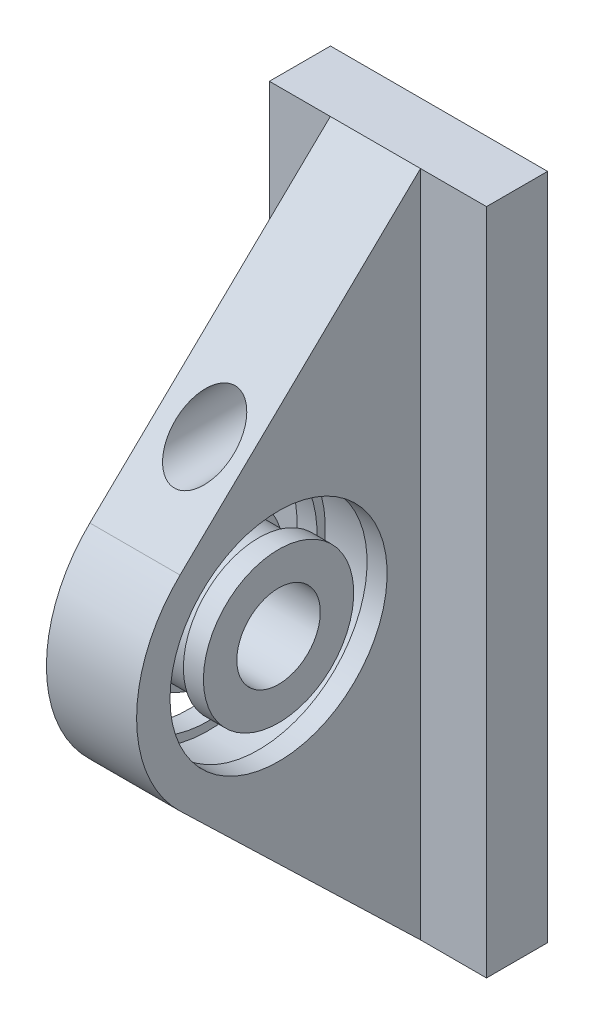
ISO-10303-21;
HEADER;
FILE_DESCRIPTION(('STEP AP214'),'2;1');
FILE_NAME('part.step','',(''),(''),'','','');
FILE_SCHEMA(('AUTOMOTIVE_DESIGN { 1 0 10303 214 1 1 1 1 }'));
ENDSEC;
DATA;
#1=APPLICATION_CONTEXT('core data for automotive mechanical design processes');
#2=APPLICATION_PROTOCOL_DEFINITION('international standard','automotive_design',2000,#1);
#3=PRODUCT_CONTEXT('',#1,'mechanical');
#4=PRODUCT('Part','Part','',(#3));
#5=PRODUCT_RELATED_PRODUCT_CATEGORY('part','',(#4));
#6=PRODUCT_DEFINITION_FORMATION('','',#4);
#7=PRODUCT_DEFINITION_CONTEXT('part definition',#1,'design');
#8=PRODUCT_DEFINITION('design','',#6,#7);
#9=PRODUCT_DEFINITION_SHAPE('','',#8);
#10=(LENGTH_UNIT() NAMED_UNIT(*) SI_UNIT(.MILLI.,.METRE.));
#11=(NAMED_UNIT(*) PLANE_ANGLE_UNIT() SI_UNIT($,.RADIAN.));
#12=(NAMED_UNIT(*) SI_UNIT($,.STERADIAN.) SOLID_ANGLE_UNIT());
#13=UNCERTAINTY_MEASURE_WITH_UNIT(LENGTH_MEASURE(1.E-05),#10,'distance_accuracy_value','');
#14=(GEOMETRIC_REPRESENTATION_CONTEXT(3) GLOBAL_UNCERTAINTY_ASSIGNED_CONTEXT((#13)) GLOBAL_UNIT_ASSIGNED_CONTEXT((#10,
#11,#12)) REPRESENTATION_CONTEXT('',''));
#15=CARTESIAN_POINT('',(0.,0.,0.));
#16=DIRECTION('',(0.,0.,1.));
#17=DIRECTION('',(1.,0.,0.));
#18=AXIS2_PLACEMENT_3D('',#15,#16,#17);
#19=CARTESIAN_POINT('',(19.2380020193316,4.49010040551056,0.));
#20=DIRECTION('',(1.,0.,0.));
#21=DIRECTION('',(0.,0.,-1.));
#22=AXIS2_PLACEMENT_3D('',#19,#20,#21);
#23=PLANE('',#22);
#24=CARTESIAN_POINT('',(19.2380020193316,1.99010040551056,0.));
#25=DIRECTION('',(-1.,0.,0.));
#26=DIRECTION('',(0.,0.,1.));
#27=AXIS2_PLACEMENT_3D('',#24,#25,#26);
#28=CIRCLE('',#27,2.5);
#29=CARTESIAN_POINT('',(19.2380020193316,1.99010040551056,2.5));
#30=VERTEX_POINT('',#29);
#31=EDGE_CURVE('E68',#30,#30,#28,.T.);
#32=ORIENTED_EDGE('',*,*,#31,.F.);
#33=EDGE_LOOP('',(#32));
#34=FACE_BOUND('',#33,.T.);
#35=CARTESIAN_POINT('',(19.2380020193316,1.99010040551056,0.));
#36=DIRECTION('',(-1.,0.,0.));
#37=DIRECTION('',(0.,0.,1.));
#38=AXIS2_PLACEMENT_3D('',#35,#36,#37);
#39=CIRCLE('',#38,4.5);
#40=CARTESIAN_POINT('',(19.2380020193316,1.99010040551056,4.5));
#41=VERTEX_POINT('',#40);
#42=EDGE_CURVE('E11',#41,#41,#39,.T.);
#43=ORIENTED_EDGE('',*,*,#42,.T.);
#44=EDGE_LOOP('',(#43));
#45=FACE_BOUND('',#44,.T.);
#46=ADVANCED_FACE('F40',(#34,#45),#23,.F.);
#47=CARTESIAN_POINT('',(17.1856373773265,1.99010040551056,0.));
#48=DIRECTION('',(-1.,0.,0.));
#49=DIRECTION('',(0.,0.,1.));
#50=AXIS2_PLACEMENT_3D('',#47,#48,#49);
#51=CYLINDRICAL_SURFACE('',#50,4.5);
#52=ORIENTED_EDGE('',*,*,#42,.F.);
#53=EDGE_LOOP('',(#52));
#54=FACE_BOUND('',#53,.T.);
#55=CARTESIAN_POINT('',(20.4380020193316,1.99010040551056,0.));
#56=DIRECTION('',(-1.,0.,0.));
#57=DIRECTION('',(0.,0.,1.));
#58=AXIS2_PLACEMENT_3D('',#55,#56,#57);
#59=CIRCLE('',#58,4.5);
#60=CARTESIAN_POINT('',(20.4380020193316,1.99010040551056,4.5));
#61=VERTEX_POINT('',#60);
#62=EDGE_CURVE('E46',#61,#61,#59,.T.);
#63=ORIENTED_EDGE('',*,*,#62,.T.);
#64=EDGE_LOOP('',(#63));
#65=FACE_BOUND('',#64,.T.);
#66=ADVANCED_FACE('F75',(#54,#65),#51,.T.);
#67=CARTESIAN_POINT('',(20.4380020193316,6.49010040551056,0.));
#68=DIRECTION('',(-1.,0.,0.));
#69=DIRECTION('',(0.,0.,1.));
#70=AXIS2_PLACEMENT_3D('',#67,#68,#69);
#71=PLANE('',#70);
#72=ORIENTED_EDGE('',*,*,#62,.F.);
#73=EDGE_LOOP('',(#72));
#74=FACE_BOUND('',#73,.T.);
#75=CARTESIAN_POINT('',(20.4380020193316,1.99010040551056,0.));
#76=DIRECTION('',(-1.,0.,0.));
#77=DIRECTION('',(0.,0.,1.));
#78=AXIS2_PLACEMENT_3D('',#75,#76,#77);
#79=CIRCLE('',#78,4.);
#80=CARTESIAN_POINT('',(20.4380020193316,1.99010040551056,4.));
#81=VERTEX_POINT('',#80);
#82=EDGE_CURVE('E50',#81,#81,#79,.T.);
#83=ORIENTED_EDGE('',*,*,#82,.T.);
#84=EDGE_LOOP('',(#83));
#85=FACE_BOUND('',#84,.T.);
#86=ADVANCED_FACE('F79',(#74,#85),#71,.F.);
#87=CARTESIAN_POINT('',(17.1856373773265,1.99010040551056,0.));
#88=DIRECTION('',(-1.,0.,0.));
#89=DIRECTION('',(0.,0.,1.));
#90=AXIS2_PLACEMENT_3D('',#87,#88,#89);
#91=CYLINDRICAL_SURFACE('',#90,4.);
#92=ORIENTED_EDGE('',*,*,#82,.F.);
#93=EDGE_LOOP('',(#92));
#94=FACE_BOUND('',#93,.T.);
#95=CARTESIAN_POINT('',(23.4380020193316,1.99010040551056,0.));
#96=DIRECTION('',(-1.,0.,0.));
#97=DIRECTION('',(0.,0.,1.));
#98=AXIS2_PLACEMENT_3D('',#95,#96,#97);
#99=CIRCLE('',#98,4.);
#100=CARTESIAN_POINT('',(23.4380020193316,1.99010040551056,4.));
#101=VERTEX_POINT('',#100);
#102=EDGE_CURVE('E54',#101,#101,#99,.T.);
#103=ORIENTED_EDGE('',*,*,#102,.T.);
#104=EDGE_LOOP('',(#103));
#105=FACE_BOUND('',#104,.T.);
#106=ADVANCED_FACE('F84',(#94,#105),#91,.T.);
#107=CARTESIAN_POINT('',(23.4380020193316,6.49010040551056,0.));
#108=DIRECTION('',(1.,0.,0.));
#109=DIRECTION('',(0.,0.,-1.));
#110=AXIS2_PLACEMENT_3D('',#107,#108,#109);
#111=PLANE('',#110);
#112=ORIENTED_EDGE('',*,*,#102,.F.);
#113=EDGE_LOOP('',(#112));
#114=FACE_BOUND('',#113,.T.);
#115=CARTESIAN_POINT('',(23.4380020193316,1.99010040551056,0.));
#116=DIRECTION('',(-1.,0.,0.));
#117=DIRECTION('',(0.,0.,1.));
#118=AXIS2_PLACEMENT_3D('',#115,#116,#117);
#119=CIRCLE('',#118,4.5);
#120=CARTESIAN_POINT('',(23.4380020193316,1.99010040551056,4.5));
#121=VERTEX_POINT('',#120);
#122=EDGE_CURVE('E59',#121,#121,#119,.T.);
#123=ORIENTED_EDGE('',*,*,#122,.T.);
#124=EDGE_LOOP('',(#123));
#125=FACE_BOUND('',#124,.T.);
#126=ADVANCED_FACE('F90',(#114,#125),#111,.F.);
#127=CARTESIAN_POINT('',(17.1856373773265,1.99010040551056,0.));
#128=DIRECTION('',(-1.,0.,0.));
#129=DIRECTION('',(0.,0.,1.));
#130=AXIS2_PLACEMENT_3D('',#127,#128,#129);
#131=CYLINDRICAL_SURFACE('',#130,4.5);
#132=ORIENTED_EDGE('',*,*,#122,.F.);
#133=EDGE_LOOP('',(#132));
#134=FACE_BOUND('',#133,.T.);
#135=CARTESIAN_POINT('',(24.6380020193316,1.99010040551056,0.));
#136=DIRECTION('',(-1.,0.,0.));
#137=DIRECTION('',(0.,0.,1.));
#138=AXIS2_PLACEMENT_3D('',#135,#136,#137);
#139=CIRCLE('',#138,4.5);
#140=CARTESIAN_POINT('',(24.6380020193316,1.99010040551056,4.5));
#141=VERTEX_POINT('',#140);
#142=EDGE_CURVE('E62',#141,#141,#139,.T.);
#143=ORIENTED_EDGE('',*,*,#142,.T.);
#144=EDGE_LOOP('',(#143));
#145=FACE_BOUND('',#144,.T.);
#146=ADVANCED_FACE('F94',(#134,#145),#131,.T.);
#147=CARTESIAN_POINT('',(24.6380020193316,4.49010040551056,0.));
#148=DIRECTION('',(-1.,0.,0.));
#149=DIRECTION('',(0.,0.,1.));
#150=AXIS2_PLACEMENT_3D('',#147,#148,#149);
#151=PLANE('',#150);
#152=ORIENTED_EDGE('',*,*,#142,.F.);
#153=EDGE_LOOP('',(#152));
#154=FACE_BOUND('',#153,.T.);
#155=CARTESIAN_POINT('',(24.6380020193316,1.99010040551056,0.));
#156=DIRECTION('',(-1.,0.,0.));
#157=DIRECTION('',(0.,0.,1.));
#158=AXIS2_PLACEMENT_3D('',#155,#156,#157);
#159=CIRCLE('',#158,2.5);
#160=CARTESIAN_POINT('',(24.6380020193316,1.99010040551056,2.5));
#161=VERTEX_POINT('',#160);
#162=EDGE_CURVE('E65',#161,#161,#159,.T.);
#163=ORIENTED_EDGE('',*,*,#162,.T.);
#164=EDGE_LOOP('',(#163));
#165=FACE_BOUND('',#164,.T.);
#166=ADVANCED_FACE('F98',(#154,#165),#151,.F.);
#167=CARTESIAN_POINT('',(17.1856373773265,1.99010040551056,0.));
#168=DIRECTION('',(-1.,0.,0.));
#169=DIRECTION('',(0.,0.,1.));
#170=AXIS2_PLACEMENT_3D('',#167,#168,#169);
#171=CYLINDRICAL_SURFACE('',#170,2.5);
#172=ORIENTED_EDGE('',*,*,#162,.F.);
#173=EDGE_LOOP('',(#172));
#174=FACE_BOUND('',#173,.T.);
#175=ORIENTED_EDGE('',*,*,#31,.T.);
#176=EDGE_LOOP('',(#175));
#177=FACE_BOUND('',#176,.T.);
#178=ADVANCED_FACE('F72',(#174,#177),#171,.F.);
#179=CLOSED_SHELL('',(#46,#66,#86,#106,#126,#146,#166,#178));
#180=MANIFOLD_SOLID_BREP('B2',#179);
#181=CARTESIAN_POINT('',(28.5880020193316,21.9901004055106,-8.5));
#182=DIRECTION('',(0.,0.,-1.));
#183=DIRECTION('',(0.,1.,0.));
#184=AXIS2_PLACEMENT_3D('',#181,#182,#183);
#185=PLANE('',#184);
#186=DIRECTION('',(0.,-1.,0.));
#187=VECTOR('',#186,1.);
#188=CARTESIAN_POINT('',(19.2380020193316,1.99010040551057,-8.5));
#189=LINE('',#188,#187);
#190=CARTESIAN_POINT('',(19.2380020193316,21.9901004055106,-8.5));
#191=VERTEX_POINT('',#190);
#192=CARTESIAN_POINT('',(19.2380020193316,-18.0098995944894,-8.5));
#193=VERTEX_POINT('',#192);
#194=EDGE_CURVE('E226',#191,#193,#189,.T.);
#195=ORIENTED_EDGE('',*,*,#194,.F.);
#196=DIRECTION('',(-1.,0.,0.));
#197=VECTOR('',#196,1.);
#198=CARTESIAN_POINT('',(28.5880020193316,21.9901004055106,-8.5));
#199=LINE('',#198,#197);
#200=CARTESIAN_POINT('',(15.5880020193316,21.9901004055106,-8.5));
#201=VERTEX_POINT('',#200);
#202=EDGE_CURVE('E229',#191,#201,#199,.T.);
#203=ORIENTED_EDGE('',*,*,#202,.T.);
#204=DIRECTION('',(0.,-1.,0.));
#205=VECTOR('',#204,1.);
#206=CARTESIAN_POINT('',(15.5880020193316,21.9901004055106,-8.5));
#207=LINE('',#206,#205);
#208=CARTESIAN_POINT('',(15.5880020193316,-18.0098995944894,-8.5));
#209=VERTEX_POINT('',#208);
#210=EDGE_CURVE('E269',#201,#209,#207,.T.);
#211=ORIENTED_EDGE('',*,*,#210,.T.);
#212=DIRECTION('',(-1.,0.,0.));
#213=VECTOR('',#212,1.);
#214=CARTESIAN_POINT('',(28.5880020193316,-18.0098995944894,-8.5));
#215=LINE('',#214,#213);
#216=EDGE_CURVE('E231',#193,#209,#215,.T.);
#217=ORIENTED_EDGE('',*,*,#216,.F.);
#218=EDGE_LOOP('',(#195,#203,#211,#217));
#219=FACE_BOUND('',#218,.T.);
#220=ADVANCED_FACE('F161',(#219),#185,.F.);
#221=CARTESIAN_POINT('',(17.1856373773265,1.99010040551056,0.));
#222=DIRECTION('',(-1.,0.,0.));
#223=DIRECTION('',(0.,0.,1.));
#224=AXIS2_PLACEMENT_3D('',#221,#222,#223);
#225=CYLINDRICAL_SURFACE('',#224,6.5);
#226=CARTESIAN_POINT('',(20.4380020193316,1.99010040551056,0.));
#227=DIRECTION('',(-1.,0.,0.));
#228=DIRECTION('',(0.,0.,1.));
#229=AXIS2_PLACEMENT_3D('',#226,#227,#228);
#230=CIRCLE('',#229,6.5);
#231=CARTESIAN_POINT('',(20.4380020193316,1.99010040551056,6.5));
#232=VERTEX_POINT('',#231);
#233=EDGE_CURVE('E38',#232,#232,#230,.T.);
#234=ORIENTED_EDGE('',*,*,#233,.F.);
#235=EDGE_LOOP('',(#234));
#236=FACE_BOUND('',#235,.T.);
#237=CARTESIAN_POINT('',(19.2380020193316,1.99010040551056,0.));
#238=DIRECTION('',(-1.,0.,0.));
#239=DIRECTION('',(0.,0.,1.));
#240=AXIS2_PLACEMENT_3D('',#237,#238,#239);
#241=CIRCLE('',#240,6.5);
#242=CARTESIAN_POINT('',(19.2380020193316,1.99010040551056,6.5));
#243=VERTEX_POINT('',#242);
#244=EDGE_CURVE('E302',#243,#243,#241,.T.);
#245=ORIENTED_EDGE('',*,*,#244,.T.);
#246=EDGE_LOOP('',(#245));
#247=FACE_BOUND('',#246,.T.);
#248=ADVANCED_FACE('F163',(#236,#247),#225,.F.);
#249=CARTESIAN_POINT('',(20.4380020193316,8.49010040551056,0.));
#250=DIRECTION('',(-1.,0.,0.));
#251=DIRECTION('',(0.,0.,1.));
#252=AXIS2_PLACEMENT_3D('',#249,#250,#251);
#253=PLANE('',#252);
#254=CARTESIAN_POINT('',(20.4380020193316,1.99010040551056,0.));
#255=DIRECTION('',(-1.,0.,0.));
#256=DIRECTION('',(0.,0.,1.));
#257=AXIS2_PLACEMENT_3D('',#254,#255,#256);
#258=CIRCLE('',#257,7.);
#259=CARTESIAN_POINT('',(20.4380020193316,1.99010040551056,7.));
#260=VERTEX_POINT('',#259);
#261=EDGE_CURVE('E170',#260,#260,#258,.T.);
#262=ORIENTED_EDGE('',*,*,#261,.F.);
#263=EDGE_LOOP('',(#262));
#264=FACE_BOUND('',#263,.T.);
#265=ORIENTED_EDGE('',*,*,#233,.T.);
#266=EDGE_LOOP('',(#265));
#267=FACE_BOUND('',#266,.T.);
#268=ADVANCED_FACE('F321',(#264,#267),#253,.F.);
#269=CARTESIAN_POINT('',(17.1856373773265,1.99010040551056,0.));
#270=DIRECTION('',(-1.,0.,0.));
#271=DIRECTION('',(0.,0.,1.));
#272=AXIS2_PLACEMENT_3D('',#269,#270,#271);
#273=CYLINDRICAL_SURFACE('',#272,7.);
#274=CARTESIAN_POINT('',(23.4380020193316,1.99010040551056,0.));
#275=DIRECTION('',(-1.,0.,0.));
#276=DIRECTION('',(0.,0.,1.));
#277=AXIS2_PLACEMENT_3D('',#274,#275,#276);
#278=CIRCLE('',#277,7.);
#279=CARTESIAN_POINT('',(23.4380020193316,1.99010040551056,7.));
#280=VERTEX_POINT('',#279);
#281=EDGE_CURVE('E313',#280,#280,#278,.T.);
#282=ORIENTED_EDGE('',*,*,#281,.F.);
#283=EDGE_LOOP('',(#282));
#284=FACE_BOUND('',#283,.T.);
#285=ORIENTED_EDGE('',*,*,#261,.T.);
#286=EDGE_LOOP('',(#285));
#287=FACE_BOUND('',#286,.T.);
#288=ADVANCED_FACE('F319',(#284,#287),#273,.F.);
#289=CARTESIAN_POINT('',(23.4380020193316,8.49010040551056,0.));
#290=DIRECTION('',(1.,0.,0.));
#291=DIRECTION('',(0.,0.,-1.));
#292=AXIS2_PLACEMENT_3D('',#289,#290,#291);
#293=PLANE('',#292);
#294=CARTESIAN_POINT('',(23.4380020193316,1.99010040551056,0.));
#295=DIRECTION('',(-1.,0.,0.));
#296=DIRECTION('',(0.,0.,1.));
#297=AXIS2_PLACEMENT_3D('',#294,#295,#296);
#298=CIRCLE('',#297,6.5);
#299=CARTESIAN_POINT('',(23.4380020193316,1.99010040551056,6.5));
#300=VERTEX_POINT('',#299);
#301=EDGE_CURVE('E310',#300,#300,#298,.T.);
#302=ORIENTED_EDGE('',*,*,#301,.F.);
#303=EDGE_LOOP('',(#302));
#304=FACE_BOUND('',#303,.T.);
#305=ORIENTED_EDGE('',*,*,#281,.T.);
#306=EDGE_LOOP('',(#305));
#307=FACE_BOUND('',#306,.T.);
#308=ADVANCED_FACE('F381',(#304,#307),#293,.F.);
#309=CARTESIAN_POINT('',(17.1856373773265,1.99010040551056,0.));
#310=DIRECTION('',(-1.,0.,0.));
#311=DIRECTION('',(0.,0.,1.));
#312=AXIS2_PLACEMENT_3D('',#309,#310,#311);
#313=CYLINDRICAL_SURFACE('',#312,6.5);
#314=CARTESIAN_POINT('',(24.6380020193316,1.99010040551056,0.));
#315=DIRECTION('',(-1.,0.,0.));
#316=DIRECTION('',(0.,0.,1.));
#317=AXIS2_PLACEMENT_3D('',#314,#315,#316);
#318=CIRCLE('',#317,6.5);
#319=CARTESIAN_POINT('',(24.6380020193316,1.99010040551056,6.5));
#320=VERTEX_POINT('',#319);
#321=EDGE_CURVE('E307',#320,#320,#318,.T.);
#322=ORIENTED_EDGE('',*,*,#321,.F.);
#323=EDGE_LOOP('',(#322));
#324=FACE_BOUND('',#323,.T.);
#325=ORIENTED_EDGE('',*,*,#301,.T.);
#326=EDGE_LOOP('',(#325));
#327=FACE_BOUND('',#326,.T.);
#328=ADVANCED_FACE('F375',(#324,#327),#313,.F.);
#329=CARTESIAN_POINT('',(24.6380020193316,10.4901004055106,0.));
#330=DIRECTION('',(-1.,0.,0.));
#331=DIRECTION('',(0.,0.,1.));
#332=AXIS2_PLACEMENT_3D('',#329,#330,#331);
#333=PLANE('',#332);
#334=CARTESIAN_POINT('',(24.6380020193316,1.99010040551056,0.));
#335=DIRECTION('',(-1.,0.,0.));
#336=DIRECTION('',(0.,0.,1.));
#337=AXIS2_PLACEMENT_3D('',#334,#335,#336);
#338=CIRCLE('',#337,8.5);
#339=CARTESIAN_POINT('',(24.6380020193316,-4.12954349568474,5.89914896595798));
#340=VERTEX_POINT('',#339);
#341=CARTESIAN_POINT('',(24.6380020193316,8.10974042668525,5.89915299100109));
#342=VERTEX_POINT('',#341);
#343=EDGE_CURVE('E177',#340,#342,#338,.T.);
#344=ORIENTED_EDGE('',*,*,#343,.F.);
#345=DIRECTION('',(0.,0.694017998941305,0.719957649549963));
#346=VECTOR('',#345,1.);
#347=CARTESIAN_POINT('',(24.6380020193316,-18.0098995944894,-8.5));
#348=LINE('',#347,#346);
#349=CARTESIAN_POINT('',(24.6380020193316,-18.0098995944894,-8.5));
#350=VERTEX_POINT('',#349);
#351=EDGE_CURVE('E237',#350,#340,#348,.T.);
#352=ORIENTED_EDGE('',*,*,#351,.F.);
#353=DIRECTION('',(0.,-1.,0.));
#354=VECTOR('',#353,1.);
#355=CARTESIAN_POINT('',(24.6380020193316,1.99010040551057,-8.5));
#356=LINE('',#355,#354);
#357=CARTESIAN_POINT('',(24.6380020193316,21.9901004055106,-8.5));
#358=VERTEX_POINT('',#357);
#359=EDGE_CURVE('E291',#358,#350,#356,.T.);
#360=ORIENTED_EDGE('',*,*,#359,.F.);
#361=DIRECTION('',(0.,-0.694017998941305,0.719957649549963));
#362=VECTOR('',#361,1.);
#363=CARTESIAN_POINT('',(24.6380020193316,21.9901004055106,-8.5));
#364=LINE('',#363,#362);
#365=EDGE_CURVE('E258',#358,#342,#364,.T.);
#366=ORIENTED_EDGE('',*,*,#365,.T.);
#367=EDGE_LOOP('',(#344,#352,#360,#366));
#368=FACE_BOUND('',#367,.T.);
#369=ORIENTED_EDGE('',*,*,#321,.T.);
#370=EDGE_LOOP('',(#369));
#371=FACE_BOUND('',#370,.T.);
#372=ADVANCED_FACE('F341',(#368,#371),#333,.F.);
#373=CARTESIAN_POINT('',(17.1856373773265,1.99010040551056,0.));
#374=DIRECTION('',(-1.,0.,0.));
#375=DIRECTION('',(0.,0.,1.));
#376=AXIS2_PLACEMENT_3D('',#373,#374,#375);
#377=CYLINDRICAL_SURFACE('',#376,8.5);
#378=ORIENTED_EDGE('',*,*,#343,.T.);
#379=DIRECTION('',(1.,0.,0.));
#380=VECTOR('',#379,1.);
#381=CARTESIAN_POINT('',(19.2380020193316,8.10974430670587,5.89914896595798));
#382=LINE('',#381,#380);
#383=CARTESIAN_POINT('',(19.2380020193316,8.10974042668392,5.89915299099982));
#384=VERTEX_POINT('',#383);
#385=EDGE_CURVE('E181',#384,#342,#382,.T.);
#386=ORIENTED_EDGE('',*,*,#385,.F.);
#387=CARTESIAN_POINT('',(19.2380020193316,1.99010040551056,0.));
#388=DIRECTION('',(-1.,0.,0.));
#389=DIRECTION('',(0.,0.,1.));
#390=AXIS2_PLACEMENT_3D('',#387,#388,#389);
#391=CIRCLE('',#390,8.5);
#392=CARTESIAN_POINT('',(19.2380020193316,-4.12954349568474,5.89914896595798));
#393=VERTEX_POINT('',#392);
#394=EDGE_CURVE('E261',#393,#384,#391,.T.);
#395=ORIENTED_EDGE('',*,*,#394,.F.);
#396=DIRECTION('',(1.,0.,0.));
#397=VECTOR('',#396,1.);
#398=CARTESIAN_POINT('',(19.2380020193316,-4.12954349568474,5.89914896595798));
#399=LINE('',#398,#397);
#400=EDGE_CURVE('E294',#393,#340,#399,.T.);
#401=ORIENTED_EDGE('',*,*,#400,.T.);
#402=EDGE_LOOP('',(#378,#386,#395,#401));
#403=FACE_BOUND('',#402,.T.);
#404=ADVANCED_FACE('F332',(#403),#377,.T.);
#405=CARTESIAN_POINT('',(19.2380020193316,8.49010040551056,0.));
#406=DIRECTION('',(1.,0.,0.));
#407=DIRECTION('',(0.,0.,-1.));
#408=AXIS2_PLACEMENT_3D('',#405,#406,#407);
#409=PLANE('',#408);
#410=ORIENTED_EDGE('',*,*,#244,.F.);
#411=EDGE_LOOP('',(#410));
#412=FACE_BOUND('',#411,.T.);
#413=ORIENTED_EDGE('',*,*,#394,.T.);
#414=DIRECTION('',(0.,-0.694017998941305,0.719957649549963));
#415=VECTOR('',#414,1.);
#416=CARTESIAN_POINT('',(19.2380020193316,21.9901004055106,-8.5));
#417=LINE('',#416,#415);
#418=EDGE_CURVE('E256',#191,#384,#417,.T.);
#419=ORIENTED_EDGE('',*,*,#418,.F.);
#420=ORIENTED_EDGE('',*,*,#194,.T.);
#421=DIRECTION('',(0.,0.694017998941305,0.719957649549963));
#422=VECTOR('',#421,1.);
#423=CARTESIAN_POINT('',(19.2380020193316,-18.0098995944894,-8.5));
#424=LINE('',#423,#422);
#425=EDGE_CURVE('E236',#193,#393,#424,.T.);
#426=ORIENTED_EDGE('',*,*,#425,.T.);
#427=EDGE_LOOP('',(#413,#419,#420,#426));
#428=FACE_BOUND('',#427,.T.);
#429=ADVANCED_FACE('F260',(#412,#428),#409,.F.);
#430=CARTESIAN_POINT('',(19.2380020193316,-18.0098995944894,-8.5));
#431=DIRECTION('',(0.,0.719957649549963,-0.694017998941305));
#432=DIRECTION('',(0.,0.694017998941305,0.719957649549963));
#433=AXIS2_PLACEMENT_3D('',#430,#431,#432);
#434=PLANE('',#433);
#435=CARTESIAN_POINT('',(22.0880020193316,-8.00989959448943,1.87376048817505));
#436=DIRECTION('',(0.,0.719957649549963,-0.694017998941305));
#437=DIRECTION('',(0.,-0.694017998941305,-0.719957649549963));
#438=AXIS2_PLACEMENT_3D('',#435,#436,#437);
#439=ELLIPSE('',#438,2.52154843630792,1.75);
#440=CARTESIAN_POINT('',(22.0880020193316,-9.75989959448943,0.0583524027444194));
#441=VERTEX_POINT('',#440);
#442=EDGE_CURVE('E538',#441,#441,#439,.T.);
#443=ORIENTED_EDGE('',*,*,#442,.T.);
#444=EDGE_LOOP('',(#443));
#445=FACE_BOUND('',#444,.T.);
#446=ORIENTED_EDGE('',*,*,#351,.T.);
#447=ORIENTED_EDGE('',*,*,#400,.F.);
#448=ORIENTED_EDGE('',*,*,#425,.F.);
#449=DIRECTION('',(1.,0.,0.));
#450=VECTOR('',#449,1.);
#451=CARTESIAN_POINT('',(19.2380020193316,-18.0098995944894,-8.5));
#452=LINE('',#451,#450);
#453=EDGE_CURVE('E299',#193,#350,#452,.T.);
#454=ORIENTED_EDGE('',*,*,#453,.T.);
#455=EDGE_LOOP('',(#446,#447,#448,#454));
#456=FACE_BOUND('',#455,.T.);
#457=ADVANCED_FACE('F331',(#445,#456),#434,.F.);
#458=CARTESIAN_POINT('',(28.5880020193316,21.9901004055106,-8.5));
#459=VERTEX_POINT('',#458);
#460=EDGE_CURVE('E249',#459,#358,#199,.T.);
#461=ORIENTED_EDGE('',*,*,#460,.T.);
#462=ORIENTED_EDGE('',*,*,#359,.T.);
#463=CARTESIAN_POINT('',(28.5880020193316,-18.0098995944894,-8.5));
#464=VERTEX_POINT('',#463);
#465=EDGE_CURVE('E290',#464,#350,#215,.T.);
#466=ORIENTED_EDGE('',*,*,#465,.F.);
#467=DIRECTION('',(0.,-1.,0.));
#468=VECTOR('',#467,1.);
#469=CARTESIAN_POINT('',(28.5880020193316,21.9901004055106,-8.5));
#470=LINE('',#469,#468);
#471=EDGE_CURVE('E278',#459,#464,#470,.T.);
#472=ORIENTED_EDGE('',*,*,#471,.F.);
#473=EDGE_LOOP('',(#461,#462,#466,#472));
#474=FACE_BOUND('',#473,.T.);
#475=ADVANCED_FACE('F338',(#474),#185,.F.);
#476=CARTESIAN_POINT('',(28.5880020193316,-18.0098995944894,-8.5));
#477=DIRECTION('',(0.,1.,0.));
#478=DIRECTION('',(0.,0.,1.));
#479=AXIS2_PLACEMENT_3D('',#476,#477,#478);
#480=PLANE('',#479);
#481=ORIENTED_EDGE('',*,*,#465,.T.);
#482=ORIENTED_EDGE('',*,*,#453,.F.);
#483=ORIENTED_EDGE('',*,*,#216,.T.);
#484=DIRECTION('',(0.,0.,-1.));
#485=VECTOR('',#484,1.);
#486=CARTESIAN_POINT('',(15.5880020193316,-18.0098995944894,-8.5));
#487=LINE('',#486,#485);
#488=CARTESIAN_POINT('',(15.5880020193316,-18.0098995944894,-12.1578550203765));
#489=VERTEX_POINT('',#488);
#490=EDGE_CURVE('E271',#209,#489,#487,.T.);
#491=ORIENTED_EDGE('',*,*,#490,.T.);
#492=DIRECTION('',(-1.,0.,0.));
#493=VECTOR('',#492,1.);
#494=CARTESIAN_POINT('',(28.5880020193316,-18.0098995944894,-12.1578550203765));
#495=LINE('',#494,#493);
#496=CARTESIAN_POINT('',(28.5880020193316,-18.0098995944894,-12.1578550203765));
#497=VERTEX_POINT('',#496);
#498=EDGE_CURVE('E288',#497,#489,#495,.T.);
#499=ORIENTED_EDGE('',*,*,#498,.F.);
#500=DIRECTION('',(0.,0.,-1.));
#501=VECTOR('',#500,1.);
#502=CARTESIAN_POINT('',(28.5880020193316,-18.0098995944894,-8.5));
#503=LINE('',#502,#501);
#504=EDGE_CURVE('E281',#464,#497,#503,.T.);
#505=ORIENTED_EDGE('',*,*,#504,.F.);
#506=EDGE_LOOP('',(#481,#482,#483,#491,#499,#505));
#507=FACE_BOUND('',#506,.T.);
#508=ADVANCED_FACE('F349',(#507),#480,.F.);
#509=CARTESIAN_POINT('',(28.5880020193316,21.9901004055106,-12.1578550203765));
#510=DIRECTION('',(0.,0.,1.));
#511=DIRECTION('',(0.,-1.,0.));
#512=AXIS2_PLACEMENT_3D('',#509,#510,#511);
#513=PLANE('',#512);
#514=CARTESIAN_POINT('',(22.0880020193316,-8.00989959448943,-12.1578550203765));
#515=DIRECTION('',(0.,0.,-1.));
#516=DIRECTION('',(0.,1.,0.));
#517=AXIS2_PLACEMENT_3D('',#514,#515,#516);
#518=CIRCLE('',#517,1.75);
#519=CARTESIAN_POINT('',(22.0880020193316,-6.25989959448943,-12.1578550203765));
#520=VERTEX_POINT('',#519);
#521=EDGE_CURVE('E535',#520,#520,#518,.T.);
#522=ORIENTED_EDGE('',*,*,#521,.F.);
#523=EDGE_LOOP('',(#522));
#524=FACE_BOUND('',#523,.T.);
#525=CARTESIAN_POINT('',(22.0880020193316,11.9901004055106,-12.1578550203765));
#526=DIRECTION('',(0.,0.,-1.));
#527=DIRECTION('',(0.,1.,0.));
#528=AXIS2_PLACEMENT_3D('',#525,#526,#527);
#529=CIRCLE('',#528,1.75);
#530=CARTESIAN_POINT('',(22.0880020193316,13.7401004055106,-12.1578550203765));
#531=VERTEX_POINT('',#530);
#532=EDGE_CURVE('E265',#531,#531,#529,.T.);
#533=ORIENTED_EDGE('',*,*,#532,.F.);
#534=EDGE_LOOP('',(#533));
#535=FACE_BOUND('',#534,.T.);
#536=ORIENTED_EDGE('',*,*,#498,.T.);
#537=DIRECTION('',(0.,1.,0.));
#538=VECTOR('',#537,1.);
#539=CARTESIAN_POINT('',(15.5880020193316,21.9901004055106,-12.1578550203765));
#540=LINE('',#539,#538);
#541=CARTESIAN_POINT('',(15.5880020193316,21.9901004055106,-12.1578550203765));
#542=VERTEX_POINT('',#541);
#543=EDGE_CURVE('E274',#489,#542,#540,.T.);
#544=ORIENTED_EDGE('',*,*,#543,.T.);
#545=DIRECTION('',(-1.,0.,0.));
#546=VECTOR('',#545,1.);
#547=CARTESIAN_POINT('',(28.5880020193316,21.9901004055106,-12.1578550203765));
#548=LINE('',#547,#546);
#549=CARTESIAN_POINT('',(28.5880020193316,21.9901004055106,-12.1578550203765));
#550=VERTEX_POINT('',#549);
#551=EDGE_CURVE('E286',#550,#542,#548,.T.);
#552=ORIENTED_EDGE('',*,*,#551,.F.);
#553=DIRECTION('',(0.,1.,0.));
#554=VECTOR('',#553,1.);
#555=CARTESIAN_POINT('',(28.5880020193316,21.9901004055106,-12.1578550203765));
#556=LINE('',#555,#554);
#557=EDGE_CURVE('E283',#497,#550,#556,.T.);
#558=ORIENTED_EDGE('',*,*,#557,.F.);
#559=EDGE_LOOP('',(#536,#544,#552,#558));
#560=FACE_BOUND('',#559,.T.);
#561=ADVANCED_FACE('F354',(#524,#535,#560),#513,.F.);
#562=CARTESIAN_POINT('',(28.5880020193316,21.9901004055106,-8.5));
#563=DIRECTION('',(0.,-1.,0.));
#564=DIRECTION('',(0.,0.,-1.));
#565=AXIS2_PLACEMENT_3D('',#562,#563,#564);
#566=PLANE('',#565);
#567=ORIENTED_EDGE('',*,*,#551,.T.);
#568=DIRECTION('',(0.,0.,1.));
#569=VECTOR('',#568,1.);
#570=CARTESIAN_POINT('',(15.5880020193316,21.9901004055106,-8.5));
#571=LINE('',#570,#569);
#572=EDGE_CURVE('E248',#542,#201,#571,.T.);
#573=ORIENTED_EDGE('',*,*,#572,.T.);
#574=ORIENTED_EDGE('',*,*,#202,.F.);
#575=DIRECTION('',(1.,0.,0.));
#576=VECTOR('',#575,1.);
#577=CARTESIAN_POINT('',(19.2380020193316,21.9901004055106,-8.5));
#578=LINE('',#577,#576);
#579=EDGE_CURVE('E245',#191,#358,#578,.T.);
#580=ORIENTED_EDGE('',*,*,#579,.T.);
#581=ORIENTED_EDGE('',*,*,#460,.F.);
#582=DIRECTION('',(0.,0.,1.));
#583=VECTOR('',#582,1.);
#584=CARTESIAN_POINT('',(28.5880020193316,21.9901004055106,-8.5));
#585=LINE('',#584,#583);
#586=EDGE_CURVE('E250',#550,#459,#585,.T.);
#587=ORIENTED_EDGE('',*,*,#586,.F.);
#588=EDGE_LOOP('',(#567,#573,#574,#580,#581,#587));
#589=FACE_BOUND('',#588,.T.);
#590=ADVANCED_FACE('F243',(#589),#566,.F.);
#591=CARTESIAN_POINT('',(28.5880020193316,-18.0098995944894,-8.5));
#592=DIRECTION('',(1.,0.,0.));
#593=DIRECTION('',(0.,0.,-1.));
#594=AXIS2_PLACEMENT_3D('',#591,#592,#593);
#595=PLANE('',#594);
#596=ORIENTED_EDGE('',*,*,#471,.T.);
#597=ORIENTED_EDGE('',*,*,#504,.T.);
#598=ORIENTED_EDGE('',*,*,#557,.T.);
#599=ORIENTED_EDGE('',*,*,#586,.T.);
#600=EDGE_LOOP('',(#596,#597,#598,#599));
#601=FACE_BOUND('',#600,.T.);
#602=ADVANCED_FACE('F362',(#601),#595,.T.);
#603=CARTESIAN_POINT('',(15.5880020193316,-18.0098995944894,-8.5));
#604=DIRECTION('',(1.,0.,0.));
#605=DIRECTION('',(0.,0.,-1.));
#606=AXIS2_PLACEMENT_3D('',#603,#604,#605);
#607=PLANE('',#606);
#608=ORIENTED_EDGE('',*,*,#210,.F.);
#609=ORIENTED_EDGE('',*,*,#572,.F.);
#610=ORIENTED_EDGE('',*,*,#543,.F.);
#611=ORIENTED_EDGE('',*,*,#490,.F.);
#612=EDGE_LOOP('',(#608,#609,#610,#611));
#613=FACE_BOUND('',#612,.T.);
#614=ADVANCED_FACE('F369',(#613),#607,.F.);
#615=CARTESIAN_POINT('',(19.2380020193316,21.9901004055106,-8.5));
#616=DIRECTION('',(0.,0.719957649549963,0.694017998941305));
#617=DIRECTION('',(0.,-0.694017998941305,0.719957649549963));
#618=AXIS2_PLACEMENT_3D('',#615,#616,#617);
#619=PLANE('',#618);
#620=CARTESIAN_POINT('',(22.0880020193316,11.9901004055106,1.87376048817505));
#621=DIRECTION('',(0.,0.719957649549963,0.694017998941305));
#622=DIRECTION('',(0.,0.694017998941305,-0.719957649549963));
#623=AXIS2_PLACEMENT_3D('',#620,#621,#622);
#624=ELLIPSE('',#623,2.52154843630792,1.75);
#625=CARTESIAN_POINT('',(22.0880020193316,13.7401004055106,0.058352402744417));
#626=VERTEX_POINT('',#625);
#627=EDGE_CURVE('E165',#626,#626,#624,.T.);
#628=ORIENTED_EDGE('',*,*,#627,.F.);
#629=EDGE_LOOP('',(#628));
#630=FACE_BOUND('',#629,.T.);
#631=ORIENTED_EDGE('',*,*,#365,.F.);
#632=ORIENTED_EDGE('',*,*,#579,.F.);
#633=ORIENTED_EDGE('',*,*,#418,.T.);
#634=ORIENTED_EDGE('',*,*,#385,.T.);
#635=EDGE_LOOP('',(#631,#632,#633,#634));
#636=FACE_BOUND('',#635,.T.);
#637=ADVANCED_FACE('F255',(#630,#636),#619,.T.);
#638=CARTESIAN_POINT('',(22.0880020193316,11.9901004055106,13.2421449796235));
#639=DIRECTION('',(0.,0.,-1.));
#640=DIRECTION('',(0.,1.,0.));
#641=AXIS2_PLACEMENT_3D('',#638,#639,#640);
#642=CYLINDRICAL_SURFACE('',#641,1.75);
#643=ORIENTED_EDGE('',*,*,#627,.T.);
#644=EDGE_LOOP('',(#643));
#645=FACE_BOUND('',#644,.T.);
#646=ORIENTED_EDGE('',*,*,#532,.T.);
#647=EDGE_LOOP('',(#646));
#648=FACE_BOUND('',#647,.T.);
#649=ADVANCED_FACE('F460',(#645,#648),#642,.F.);
#650=CARTESIAN_POINT('',(22.0880020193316,-8.00989959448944,13.2421449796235));
#651=DIRECTION('',(0.,0.,-1.));
#652=DIRECTION('',(0.,1.,0.));
#653=AXIS2_PLACEMENT_3D('',#650,#651,#652);
#654=CYLINDRICAL_SURFACE('',#653,1.75);
#655=ORIENTED_EDGE('',*,*,#521,.T.);
#656=EDGE_LOOP('',(#655));
#657=FACE_BOUND('',#656,.T.);
#658=ORIENTED_EDGE('',*,*,#442,.F.);
#659=EDGE_LOOP('',(#658));
#660=FACE_BOUND('',#659,.T.);
#661=ADVANCED_FACE('F471',(#657,#660),#654,.F.);
#662=CLOSED_SHELL('',(#220,#248,#268,#288,#308,#328,#372,#404,#429,#457,#475,#508,#561,#590,
#602,#614,#637,#649,#661));
#663=MANIFOLD_SOLID_BREP('B6',#662);
#664=ADVANCED_BREP_SHAPE_REPRESENTATION('',(#18,#180,#663),#14);
#665=SHAPE_DEFINITION_REPRESENTATION(#9,#664);
ENDSEC;
END-ISO-10303-21;
